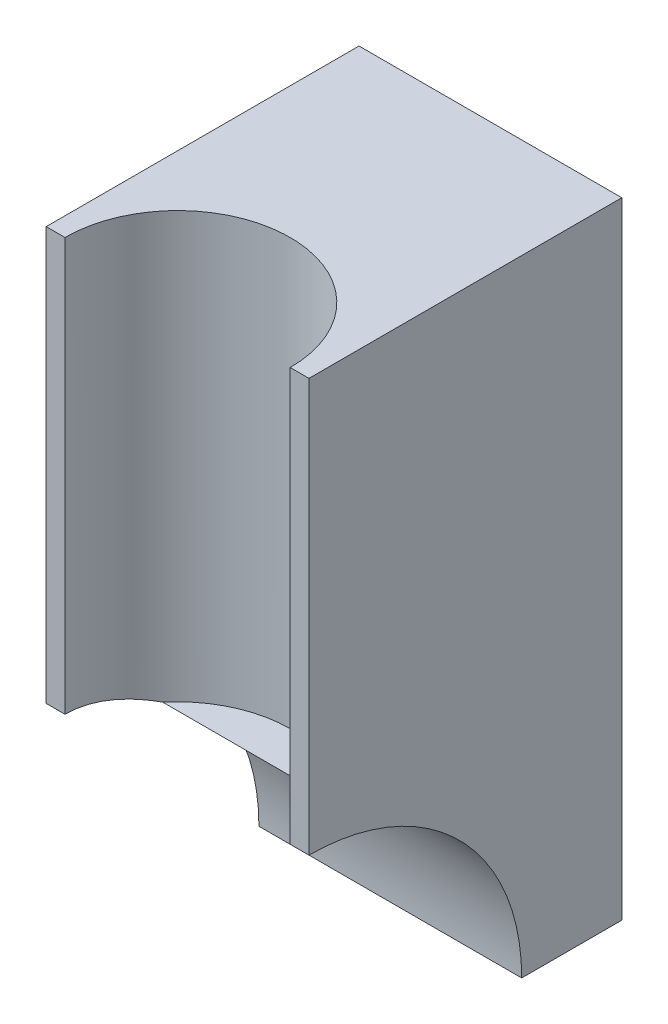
from build123d import *

# Parameters (mm, degrees)
IZIM1_W                     = 210
IZIM1_H                     = 250
Y_KSEKLIK_EKSTR_ZYON1_DEPTH = 500
KES_EKSTR_ZYON1_DEPTH       = 526.97528459
KES_EKSTR_ZYON1_DEPTH_BACK  = 526.97528459
KES_EKSTR_ZYON3_DEPTH       = 557.5294242
KES_EKSTR_ZYON3_DEPTH_BACK  = 557.5294242
IZIM5_R                     = 90
KES_EKSTR_ZYON5_DEPTH       = 340


with BuildPart() as part:
    # izim1 → Y_kseklik-Ekstr_zyon1 (new body)
    with BuildSketch(Plane(origin=(0, 0, 0), x_dir=(1, 0, 0), z_dir=(0, 1, 0))):
        Rectangle(IZIM1_W, IZIM1_H)
    extrude(amount=Y_KSEKLIK_EKSTR_ZYON1_DEPTH)

    # izim3 → Kes-Ekstr_zyon1 (cut, two sides: drawn at the far end of the back side and taken through both)
    with BuildSketch(Plane(origin=(0, 500, 0), x_dir=(-1, 0, 0), z_dir=(0, 1, 0)).offset(-KES_EKSTR_ZYON1_DEPTH_BACK)):
        with BuildLine():
            Line((-50, 723.302643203), (-50, 125))
            ThreePointArc((-50, 125), (0, 75), (50, 125))
            Line((50, 125), (50, 723.302643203))
            Line((50, 723.302643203), (50, 1919.90792961))
            Line((50, 1919.90792961), (-50, 1919.90792961))
            Line((-50, 1919.90792961), (-50, 723.302643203))
        make_face()
    extrude(amount=KES_EKSTR_ZYON1_DEPTH + KES_EKSTR_ZYON1_DEPTH_BACK, mode=Mode.SUBTRACT)

    # izim4 → Kes-Ekstr_zyon3 (cut, two sides: drawn at the far end of the back side and taken through both)
    with BuildSketch(Plane(origin=(105, 0, 0), x_dir=(0, 0, -1), z_dir=(1, 0, 0)).offset(-KES_EKSTR_ZYON3_DEPTH_BACK)):
        with BuildLine():
            Line((45, -1066.219674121), (45, 0))
            ThreePointArc((45, 0), (-4.791847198, 120.208152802), (-125, 170))
            Line((-125, 170), (-1191.219674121, 170))
            Line((-1191.219674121, 170), (-2699.081997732, -1337.862323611))
            Line((-2699.081997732, -1337.862323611), (-1462.862323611, -2574.081997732))
            Line((-1462.862323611, -2574.081997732), (45, -1066.219674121))
        make_face()
    extrude(amount=KES_EKSTR_ZYON3_DEPTH + KES_EKSTR_ZYON3_DEPTH_BACK, mode=Mode.SUBTRACT)

    # izim5 → Kes-Ekstr_zyon5 (cut)
    with BuildSketch(Plane(origin=(0, 500, 0), x_dir=(1, 0, 0), z_dir=(0, 1, 0))):
        with Locations((0, -125)):
            Circle(IZIM5_R)
    extrude(amount=-KES_EKSTR_ZYON5_DEPTH, mode=Mode.SUBTRACT)


solid = part.part
